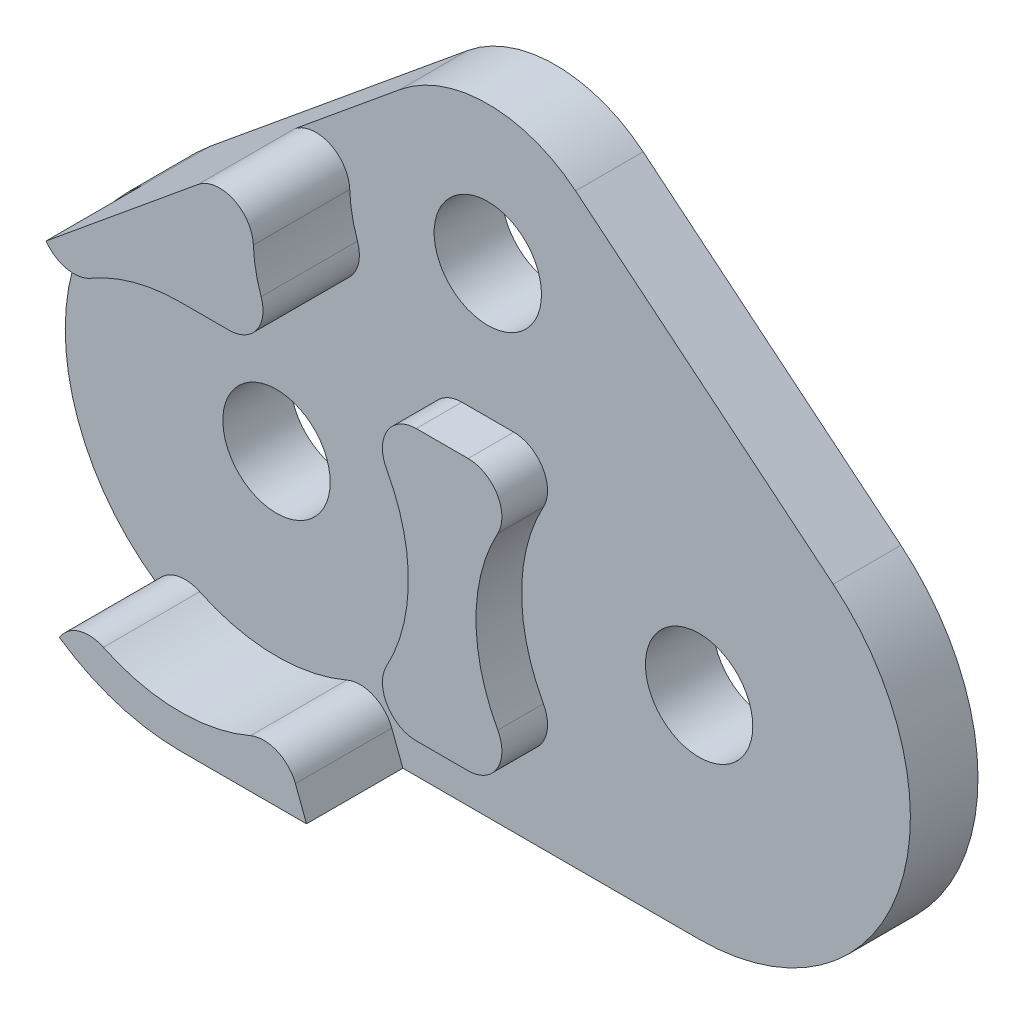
ISO-10303-21;
HEADER;
FILE_DESCRIPTION(('STEP AP214'),'2;1');
FILE_NAME('part.step','',(''),(''),'','','');
FILE_SCHEMA(('AUTOMOTIVE_DESIGN { 1 0 10303 214 1 1 1 1 }'));
ENDSEC;
DATA;
#1=APPLICATION_CONTEXT('core data for automotive mechanical design processes');
#2=APPLICATION_PROTOCOL_DEFINITION('international standard','automotive_design',2000,#1);
#3=PRODUCT_CONTEXT('',#1,'mechanical');
#4=PRODUCT('Part','Part','',(#3));
#5=PRODUCT_RELATED_PRODUCT_CATEGORY('part','',(#4));
#6=PRODUCT_DEFINITION_FORMATION('','',#4);
#7=PRODUCT_DEFINITION_CONTEXT('part definition',#1,'design');
#8=PRODUCT_DEFINITION('design','',#6,#7);
#9=PRODUCT_DEFINITION_SHAPE('','',#8);
#10=(LENGTH_UNIT() NAMED_UNIT(*) SI_UNIT(.MILLI.,.METRE.));
#11=(NAMED_UNIT(*) PLANE_ANGLE_UNIT() SI_UNIT($,.RADIAN.));
#12=(NAMED_UNIT(*) SI_UNIT($,.STERADIAN.) SOLID_ANGLE_UNIT());
#13=UNCERTAINTY_MEASURE_WITH_UNIT(LENGTH_MEASURE(1.E-05),#10,'distance_accuracy_value','');
#14=(GEOMETRIC_REPRESENTATION_CONTEXT(3) GLOBAL_UNCERTAINTY_ASSIGNED_CONTEXT((#13)) GLOBAL_UNIT_ASSIGNED_CONTEXT((#10,
#11,#12)) REPRESENTATION_CONTEXT('',''));
#15=CARTESIAN_POINT('',(0.,0.,0.));
#16=DIRECTION('',(0.,0.,1.));
#17=DIRECTION('',(1.,0.,0.));
#18=AXIS2_PLACEMENT_3D('',#15,#16,#17);
#19=CARTESIAN_POINT('',(-6.25,0.,2.));
#20=DIRECTION('',(0.,0.,1.));
#21=DIRECTION('',(1.,0.,0.));
#22=AXIS2_PLACEMENT_3D('',#19,#20,#21);
#23=PLANE('',#22);
#24=CARTESIAN_POINT('',(6.25,0.,2.));
#25=DIRECTION('',(0.,0.,1.));
#26=DIRECTION('',(1.,0.,0.));
#27=AXIS2_PLACEMENT_3D('',#24,#25,#26);
#28=CIRCLE('',#27,1.5875);
#29=CARTESIAN_POINT('',(7.8375,0.,2.));
#30=VERTEX_POINT('',#29);
#31=EDGE_CURVE('E309',#30,#30,#28,.T.);
#32=ORIENTED_EDGE('',*,*,#31,.F.);
#33=EDGE_LOOP('',(#32));
#34=FACE_BOUND('',#33,.T.);
#35=CARTESIAN_POINT('',(-6.25,0.,2.));
#36=DIRECTION('',(0.,0.,1.));
#37=DIRECTION('',(1.,0.,0.));
#38=AXIS2_PLACEMENT_3D('',#35,#36,#37);
#39=CIRCLE('',#38,1.5875);
#40=CARTESIAN_POINT('',(-4.6625,0.,2.));
#41=VERTEX_POINT('',#40);
#42=EDGE_CURVE('E323',#41,#41,#39,.T.);
#43=ORIENTED_EDGE('',*,*,#42,.F.);
#44=EDGE_LOOP('',(#43));
#45=FACE_BOUND('',#44,.T.);
#46=CARTESIAN_POINT('',(0.,7.93750000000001,2.));
#47=DIRECTION('',(0.,0.,1.));
#48=DIRECTION('',(1.,0.,0.));
#49=AXIS2_PLACEMENT_3D('',#46,#47,#48);
#50=CIRCLE('',#49,1.5875);
#51=CARTESIAN_POINT('',(1.5875,7.93750000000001,2.));
#52=VERTEX_POINT('',#51);
#53=EDGE_CURVE('E300',#52,#52,#50,.T.);
#54=ORIENTED_EDGE('',*,*,#53,.F.);
#55=EDGE_LOOP('',(#54));
#56=FACE_BOUND('',#55,.T.);
#57=CARTESIAN_POINT('',(-6.25,0.,2.));
#58=DIRECTION('',(0.,0.,1.));
#59=DIRECTION('',(1.,0.,0.));
#60=AXIS2_PLACEMENT_3D('',#57,#58,#59);
#61=CIRCLE('',#60,5.25);
#62=CARTESIAN_POINT('',(-4.17199093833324,-4.82124240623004,2.));
#63=VERTEX_POINT('',#62);
#64=CARTESIAN_POINT('',(-8.52200352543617,-4.73291664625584,2.));
#65=VERTEX_POINT('',#64);
#66=EDGE_CURVE('E252',#63,#65,#61,.F.);
#67=ORIENTED_EDGE('',*,*,#66,.F.);
#68=CARTESIAN_POINT('',(-3.77617968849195,-5.739574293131,2.));
#69=DIRECTION('',(0.,0.,1.));
#70=DIRECTION('',(1.,0.,0.));
#71=AXIS2_PLACEMENT_3D('',#68,#69,#70);
#72=CIRCLE('',#71,1.);
#73=CARTESIAN_POINT('',(-2.84132364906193,-5.38454727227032,2.));
#74=VERTEX_POINT('',#73);
#75=EDGE_CURVE('E411',#63,#74,#72,.F.);
#76=ORIENTED_EDGE('',*,*,#75,.T.);
#77=DIRECTION('',(0.35502702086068,-0.934856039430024,0.));
#78=VECTOR('',#77,1.);
#79=CARTESIAN_POINT('',(-4.27031801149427,-1.62172379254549,2.));
#80=LINE('',#79,#78);
#81=CARTESIAN_POINT('',(-2.51265368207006,-6.25,2.));
#82=VERTEX_POINT('',#81);
#83=EDGE_CURVE('E250',#74,#82,#80,.T.);
#84=ORIENTED_EDGE('',*,*,#83,.T.);
#85=DIRECTION('',(1.,0.,0.));
#86=VECTOR('',#85,1.);
#87=CARTESIAN_POINT('',(-6.25,-6.25,2.));
#88=LINE('',#87,#86);
#89=CARTESIAN_POINT('',(6.25,-6.25000000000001,2.));
#90=VERTEX_POINT('',#89);
#91=EDGE_CURVE('E334',#82,#90,#88,.T.);
#92=ORIENTED_EDGE('',*,*,#91,.T.);
#93=CARTESIAN_POINT('',(6.25,0.,2.));
#94=DIRECTION('',(0.,0.,1.));
#95=DIRECTION('',(-1.,0.,0.));
#96=AXIS2_PLACEMENT_3D('',#93,#94,#95);
#97=CIRCLE('',#96,6.25);
#98=CARTESIAN_POINT('',(10.2190264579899,4.8279735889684,2.));
#99=VERTEX_POINT('',#98);
#100=EDGE_CURVE('E337',#90,#99,#97,.T.);
#101=ORIENTED_EDGE('',*,*,#100,.T.);
#102=DIRECTION('',(0.772475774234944,-0.635044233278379,0.));
#103=VECTOR('',#102,1.);
#104=CARTESIAN_POINT('',(6.48953382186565,7.8939503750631,2.));
#105=LINE('',#104,#103);
#106=CARTESIAN_POINT('',(2.59574330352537,11.0949947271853,2.));
#107=VERTEX_POINT('',#106);
#108=EDGE_CURVE('E290',#107,#99,#105,.T.);
#109=ORIENTED_EDGE('',*,*,#108,.F.);
#110=CARTESIAN_POINT('',(0.,7.93750000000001,2.));
#111=DIRECTION('',(0.,0.,1.));
#112=DIRECTION('',(1.,0.,0.));
#113=AXIS2_PLACEMENT_3D('',#110,#111,#112);
#114=CIRCLE('',#113,4.0875);
#115=CARTESIAN_POINT('',(-2.59574330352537,11.0949947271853,2.));
#116=VERTEX_POINT('',#115);
#117=EDGE_CURVE('E295',#116,#107,#114,.F.);
#118=ORIENTED_EDGE('',*,*,#117,.F.);
#119=DIRECTION('',(0.772475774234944,0.635044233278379,0.));
#120=VECTOR('',#119,1.);
#121=CARTESIAN_POINT('',(-6.48953382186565,7.8939503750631,2.));
#122=LINE('',#121,#120);
#123=CARTESIAN_POINT('',(-5.71925938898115,8.52718490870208,2.));
#124=VERTEX_POINT('',#123);
#125=EDGE_CURVE('E406',#124,#116,#122,.T.);
#126=ORIENTED_EDGE('',*,*,#125,.F.);
#127=CARTESIAN_POINT('',(-5.08421515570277,7.75470913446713,2.));
#128=DIRECTION('',(0.,0.,1.));
#129=DIRECTION('',(1.,0.,0.));
#130=AXIS2_PLACEMENT_3D('',#127,#128,#129);
#131=CIRCLE('',#130,1.);
#132=CARTESIAN_POINT('',(-4.0848608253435,7.79063854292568,2.));
#133=VERTEX_POINT('',#132);
#134=EDGE_CURVE('E11',#124,#133,#131,.F.);
#135=ORIENTED_EDGE('',*,*,#134,.T.);
#136=CARTESIAN_POINT('',(0.,7.93750000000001,2.));
#137=DIRECTION('',(0.,0.,1.));
#138=DIRECTION('',(1.,0.,0.));
#139=AXIS2_PLACEMENT_3D('',#136,#137,#138);
#140=CIRCLE('',#139,4.0875);
#141=CARTESIAN_POINT('',(-3.85609257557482,6.58169533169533,2.));
#142=VERTEX_POINT('',#141);
#143=EDGE_CURVE('E277',#142,#133,#140,.F.);
#144=ORIENTED_EDGE('',*,*,#143,.F.);
#145=CARTESIAN_POINT('',(-4.79947913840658,6.25,2.));
#146=DIRECTION('',(0.,0.,1.));
#147=DIRECTION('',(1.,0.,0.));
#148=AXIS2_PLACEMENT_3D('',#145,#146,#147);
#149=CIRCLE('',#148,1.);
#150=CARTESIAN_POINT('',(-4.79947913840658,5.25,2.));
#151=VERTEX_POINT('',#150);
#152=EDGE_CURVE('E43',#142,#151,#149,.F.);
#153=ORIENTED_EDGE('',*,*,#152,.T.);
#154=DIRECTION('',(1.,0.,0.));
#155=VECTOR('',#154,1.);
#156=CARTESIAN_POINT('',(0.,5.24999999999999,2.));
#157=LINE('',#156,#155);
#158=CARTESIAN_POINT('',(-6.25,5.25,2.));
#159=VERTEX_POINT('',#158);
#160=EDGE_CURVE('E239',#159,#151,#157,.T.);
#161=ORIENTED_EDGE('',*,*,#160,.F.);
#162=CARTESIAN_POINT('',(-6.25,0.,2.));
#163=DIRECTION('',(0.,0.,1.));
#164=DIRECTION('',(1.,0.,0.));
#165=AXIS2_PLACEMENT_3D('',#162,#163,#164);
#166=CIRCLE('',#165,5.25);
#167=CARTESIAN_POINT('',(-8.8921509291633,4.53668805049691,2.));
#168=VERTEX_POINT('',#167);
#169=EDGE_CURVE('E264',#159,#168,#166,.T.);
#170=ORIENTED_EDGE('',*,*,#169,.T.);
#171=CARTESIAN_POINT('',(-9.39541777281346,5.40081910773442,2.));
#172=DIRECTION('',(0.,0.,1.));
#173=DIRECTION('',(1.,0.,0.));
#174=AXIS2_PLACEMENT_3D('',#171,#172,#173);
#175=CIRCLE('',#174,1.);
#176=CARTESIAN_POINT('',(-10.1678935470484,4.76577487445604,2.));
#177=VERTEX_POINT('',#176);
#178=EDGE_CURVE('E423',#168,#177,#175,.F.);
#179=ORIENTED_EDGE('',*,*,#178,.T.);
#180=DIRECTION('',(-0.635044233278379,0.772475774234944,0.));
#181=VECTOR('',#180,1.);
#182=CARTESIAN_POINT('',(-3.72949263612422,-3.0659767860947,2.));
#183=LINE('',#182,#181);
#184=CARTESIAN_POINT('',(-10.2190264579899,4.8279735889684,2.));
#185=VERTEX_POINT('',#184);
#186=EDGE_CURVE('E280',#177,#185,#183,.T.);
#187=ORIENTED_EDGE('',*,*,#186,.T.);
#188=CARTESIAN_POINT('',(-6.25,0.,2.));
#189=DIRECTION('',(0.,0.,1.));
#190=DIRECTION('',(1.,0.,0.));
#191=AXIS2_PLACEMENT_3D('',#188,#189,#190);
#192=CIRCLE('',#191,6.25);
#193=CARTESIAN_POINT('',(-9.82142857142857,-5.12907379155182,2.));
#194=VERTEX_POINT('',#193);
#195=EDGE_CURVE('E332',#185,#194,#192,.T.);
#196=ORIENTED_EDGE('',*,*,#195,.T.);
#197=DIRECTION('',(-0.571428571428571,-0.82065180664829,0.));
#198=VECTOR('',#197,1.);
#199=CARTESIAN_POINT('',(-4.2091836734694,2.93089930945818,2.));
#200=LINE('',#199,#198);
#201=CARTESIAN_POINT('',(-9.77541790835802,-5.06299600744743,2.));
#202=VERTEX_POINT('',#201);
#203=EDGE_CURVE('E235',#202,#194,#200,.T.);
#204=ORIENTED_EDGE('',*,*,#203,.F.);
#205=CARTESIAN_POINT('',(-8.95476610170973,-5.634424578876,2.));
#206=DIRECTION('',(0.,0.,1.));
#207=DIRECTION('',(1.,0.,0.));
#208=AXIS2_PLACEMENT_3D('',#205,#206,#207);
#209=CIRCLE('',#208,1.);
#210=EDGE_CURVE('E421',#202,#65,#209,.F.);
#211=ORIENTED_EDGE('',*,*,#210,.T.);
#212=EDGE_LOOP('',(#67,#76,#84,#92,#101,#109,#118,#126,#135,#144,#153,#161,#170,#179,#187,#196,
#204,#211));
#213=FACE_BOUND('',#212,.T.);
#214=DIRECTION('',(1.,0.,0.));
#215=VECTOR('',#214,1.);
#216=CARTESIAN_POINT('',(-2.84963237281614,-4.,2.));
#217=LINE('',#216,#215);
#218=CARTESIAN_POINT('',(-0.767071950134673,-4.,2.));
#219=VERTEX_POINT('',#218);
#220=CARTESIAN_POINT('',(0.767071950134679,-4.,2.));
#221=VERTEX_POINT('',#220);
#222=EDGE_CURVE('E547',#219,#221,#217,.T.);
#223=ORIENTED_EDGE('',*,*,#222,.F.);
#224=CARTESIAN_POINT('',(-0.767071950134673,-3.,2.));
#225=DIRECTION('',(0.,0.,1.));
#226=DIRECTION('',(1.,0.,0.));
#227=AXIS2_PLACEMENT_3D('',#224,#225,#226);
#228=CIRCLE('',#227,1.);
#229=CARTESIAN_POINT('',(-1.64434043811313,-2.52,2.));
#230=VERTEX_POINT('',#229);
#231=EDGE_CURVE('E413',#219,#230,#228,.F.);
#232=ORIENTED_EDGE('',*,*,#231,.T.);
#233=CARTESIAN_POINT('',(-6.25,0.,2.));
#234=DIRECTION('',(0.,0.,-1.));
#235=DIRECTION('',(-1.,0.,0.));
#236=AXIS2_PLACEMENT_3D('',#233,#234,#235);
#237=CIRCLE('',#236,5.25);
#238=CARTESIAN_POINT('',(-1.64434043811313,2.52,2.));
#239=VERTEX_POINT('',#238);
#240=EDGE_CURVE('E544',#239,#230,#237,.T.);
#241=ORIENTED_EDGE('',*,*,#240,.F.);
#242=CARTESIAN_POINT('',(-0.767071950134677,3.,2.));
#243=DIRECTION('',(0.,0.,1.));
#244=DIRECTION('',(1.,0.,0.));
#245=AXIS2_PLACEMENT_3D('',#242,#243,#244);
#246=CIRCLE('',#245,1.);
#247=CARTESIAN_POINT('',(-0.767071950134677,4.,2.));
#248=VERTEX_POINT('',#247);
#249=EDGE_CURVE('E419',#239,#248,#246,.F.);
#250=ORIENTED_EDGE('',*,*,#249,.T.);
#251=DIRECTION('',(-1.,0.,0.));
#252=VECTOR('',#251,1.);
#253=CARTESIAN_POINT('',(-2.84963237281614,4.,2.));
#254=LINE('',#253,#252);
#255=CARTESIAN_POINT('',(0.76707195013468,4.,2.));
#256=VERTEX_POINT('',#255);
#257=EDGE_CURVE('E553',#256,#248,#254,.T.);
#258=ORIENTED_EDGE('',*,*,#257,.F.);
#259=CARTESIAN_POINT('',(0.76707195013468,3.,2.));
#260=DIRECTION('',(0.,0.,1.));
#261=DIRECTION('',(1.,0.,0.));
#262=AXIS2_PLACEMENT_3D('',#259,#260,#261);
#263=CIRCLE('',#262,1.);
#264=CARTESIAN_POINT('',(1.64434043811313,2.52,2.));
#265=VERTEX_POINT('',#264);
#266=EDGE_CURVE('E417',#256,#265,#263,.F.);
#267=ORIENTED_EDGE('',*,*,#266,.T.);
#268=CARTESIAN_POINT('',(6.25,0.,2.));
#269=DIRECTION('',(0.,0.,-1.));
#270=DIRECTION('',(1.,0.,0.));
#271=AXIS2_PLACEMENT_3D('',#268,#269,#270);
#272=CIRCLE('',#271,5.25);
#273=CARTESIAN_POINT('',(1.64434043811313,-2.52,2.));
#274=VERTEX_POINT('',#273);
#275=EDGE_CURVE('E550',#274,#265,#272,.T.);
#276=ORIENTED_EDGE('',*,*,#275,.F.);
#277=CARTESIAN_POINT('',(0.767071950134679,-3.,2.));
#278=DIRECTION('',(0.,0.,1.));
#279=DIRECTION('',(1.,0.,0.));
#280=AXIS2_PLACEMENT_3D('',#277,#278,#279);
#281=CIRCLE('',#280,1.);
#282=EDGE_CURVE('E415',#274,#221,#281,.F.);
#283=ORIENTED_EDGE('',*,*,#282,.T.);
#284=EDGE_LOOP('',(#223,#232,#241,#250,#258,#267,#276,#283));
#285=FACE_BOUND('',#284,.T.);
#286=ADVANCED_FACE('F35',(#34,#45,#56,#213,#285),#23,.T.);
#287=CARTESIAN_POINT('',(6.25,0.,2.));
#288=DIRECTION('',(0.,0.,-1.));
#289=DIRECTION('',(-1.,0.,0.));
#290=AXIS2_PLACEMENT_3D('',#287,#288,#289);
#291=CYLINDRICAL_SURFACE('',#290,6.25);
#292=DIRECTION('',(0.,0.,1.));
#293=VECTOR('',#292,1.);
#294=CARTESIAN_POINT('',(10.2190264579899,4.8279735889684,-21.668207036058));
#295=LINE('',#294,#293);
#296=CARTESIAN_POINT('',(10.2190264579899,4.8279735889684,0.));
#297=VERTEX_POINT('',#296);
#298=EDGE_CURVE('E293',#297,#99,#295,.T.);
#299=ORIENTED_EDGE('',*,*,#298,.T.);
#300=ORIENTED_EDGE('',*,*,#100,.F.);
#301=DIRECTION('',(0.,0.,-1.));
#302=VECTOR('',#301,1.);
#303=CARTESIAN_POINT('',(6.25,-6.25000000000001,2.));
#304=LINE('',#303,#302);
#305=CARTESIAN_POINT('',(6.25,-6.25000000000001,0.));
#306=VERTEX_POINT('',#305);
#307=EDGE_CURVE('E340',#90,#306,#304,.T.);
#308=ORIENTED_EDGE('',*,*,#307,.T.);
#309=CARTESIAN_POINT('',(6.25,0.,0.));
#310=DIRECTION('',(0.,0.,1.));
#311=DIRECTION('',(-1.,0.,0.));
#312=AXIS2_PLACEMENT_3D('',#309,#310,#311);
#313=CIRCLE('',#312,6.25);
#314=EDGE_CURVE('E335',#306,#297,#313,.T.);
#315=ORIENTED_EDGE('',*,*,#314,.T.);
#316=EDGE_LOOP('',(#299,#300,#308,#315));
#317=FACE_BOUND('',#316,.T.);
#318=ADVANCED_FACE('F482',(#317),#291,.T.);
#319=CARTESIAN_POINT('',(-6.25,0.,2.));
#320=DIRECTION('',(0.,0.,-1.));
#321=DIRECTION('',(-1.,0.,0.));
#322=AXIS2_PLACEMENT_3D('',#319,#320,#321);
#323=CYLINDRICAL_SURFACE('',#322,6.25);
#324=ORIENTED_EDGE('',*,*,#195,.F.);
#325=DIRECTION('',(0.,0.,1.));
#326=VECTOR('',#325,1.);
#327=CARTESIAN_POINT('',(-10.2190264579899,4.8279735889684,-21.668207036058));
#328=LINE('',#327,#326);
#329=CARTESIAN_POINT('',(-10.2190264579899,4.8279735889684,0.));
#330=VERTEX_POINT('',#329);
#331=EDGE_CURVE('E303',#330,#185,#328,.T.);
#332=ORIENTED_EDGE('',*,*,#331,.F.);
#333=CARTESIAN_POINT('',(-6.25,0.,0.));
#334=DIRECTION('',(0.,0.,1.));
#335=DIRECTION('',(1.,0.,0.));
#336=AXIS2_PLACEMENT_3D('',#333,#334,#335);
#337=CIRCLE('',#336,6.25);
#338=CARTESIAN_POINT('',(-6.25,-6.25,0.));
#339=VERTEX_POINT('',#338);
#340=EDGE_CURVE('E329',#330,#339,#337,.T.);
#341=ORIENTED_EDGE('',*,*,#340,.T.);
#342=DIRECTION('',(0.,0.,-1.));
#343=VECTOR('',#342,1.);
#344=CARTESIAN_POINT('',(-6.25,-6.25,2.));
#345=LINE('',#344,#343);
#346=CARTESIAN_POINT('',(-6.25,-6.25,4.85));
#347=VERTEX_POINT('',#346);
#348=EDGE_CURVE('E244',#347,#339,#345,.T.);
#349=ORIENTED_EDGE('',*,*,#348,.F.);
#350=CARTESIAN_POINT('',(-6.25,0.,4.85));
#351=DIRECTION('',(0.,0.,1.));
#352=DIRECTION('',(1.,0.,0.));
#353=AXIS2_PLACEMENT_3D('',#350,#351,#352);
#354=CIRCLE('',#353,6.25);
#355=CARTESIAN_POINT('',(-9.82142857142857,-5.12907379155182,4.85));
#356=VERTEX_POINT('',#355);
#357=EDGE_CURVE('E221',#356,#347,#354,.T.);
#358=ORIENTED_EDGE('',*,*,#357,.F.);
#359=DIRECTION('',(0.,0.,-1.));
#360=VECTOR('',#359,1.);
#361=CARTESIAN_POINT('',(-9.82142857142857,-5.12907379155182,4.85));
#362=LINE('',#361,#360);
#363=EDGE_CURVE('E232',#356,#194,#362,.T.);
#364=ORIENTED_EDGE('',*,*,#363,.T.);
#365=EDGE_LOOP('',(#324,#332,#341,#349,#358,#364));
#366=FACE_BOUND('',#365,.T.);
#367=ADVANCED_FACE('F242',(#366),#323,.T.);
#368=CARTESIAN_POINT('',(-6.25,-6.25,2.));
#369=DIRECTION('',(0.,1.,0.));
#370=DIRECTION('',(0.,0.,1.));
#371=AXIS2_PLACEMENT_3D('',#368,#369,#370);
#372=PLANE('',#371);
#373=DIRECTION('',(1.,0.,0.));
#374=VECTOR('',#373,1.);
#375=CARTESIAN_POINT('',(-6.25,-6.25,0.));
#376=LINE('',#375,#374);
#377=EDGE_CURVE('E342',#339,#306,#376,.T.);
#378=ORIENTED_EDGE('',*,*,#377,.T.);
#379=ORIENTED_EDGE('',*,*,#307,.F.);
#380=ORIENTED_EDGE('',*,*,#91,.F.);
#381=DIRECTION('',(0.,0.,-1.));
#382=VECTOR('',#381,1.);
#383=CARTESIAN_POINT('',(-2.51265368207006,-6.25,4.85));
#384=LINE('',#383,#382);
#385=CARTESIAN_POINT('',(-2.51265368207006,-6.25,4.85));
#386=VERTEX_POINT('',#385);
#387=EDGE_CURVE('E240',#386,#82,#384,.T.);
#388=ORIENTED_EDGE('',*,*,#387,.F.);
#389=DIRECTION('',(1.,0.,0.));
#390=VECTOR('',#389,1.);
#391=CARTESIAN_POINT('',(0.,-6.25,4.85));
#392=LINE('',#391,#390);
#393=EDGE_CURVE('E245',#347,#386,#392,.T.);
#394=ORIENTED_EDGE('',*,*,#393,.F.);
#395=ORIENTED_EDGE('',*,*,#348,.T.);
#396=EDGE_LOOP('',(#378,#379,#380,#388,#394,#395));
#397=FACE_BOUND('',#396,.T.);
#398=ADVANCED_FACE('F498',(#397),#372,.F.);
#399=CARTESIAN_POINT('',(-6.25,0.,0.));
#400=DIRECTION('',(0.,0.,1.));
#401=DIRECTION('',(1.,0.,0.));
#402=AXIS2_PLACEMENT_3D('',#399,#400,#401);
#403=PLANE('',#402);
#404=DIRECTION('',(-0.772475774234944,0.635044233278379,0.));
#405=VECTOR('',#404,1.);
#406=CARTESIAN_POINT('',(6.48953382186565,7.8939503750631,0.));
#407=LINE('',#406,#405);
#408=CARTESIAN_POINT('',(2.59574330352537,11.0949947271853,0.));
#409=VERTEX_POINT('',#408);
#410=EDGE_CURVE('E298',#297,#409,#407,.T.);
#411=ORIENTED_EDGE('',*,*,#410,.F.);
#412=ORIENTED_EDGE('',*,*,#314,.F.);
#413=ORIENTED_EDGE('',*,*,#377,.F.);
#414=ORIENTED_EDGE('',*,*,#340,.F.);
#415=DIRECTION('',(0.772475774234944,0.635044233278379,0.));
#416=VECTOR('',#415,1.);
#417=CARTESIAN_POINT('',(-6.48953382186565,7.8939503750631,0.));
#418=LINE('',#417,#416);
#419=CARTESIAN_POINT('',(-2.59574330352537,11.0949947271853,0.));
#420=VERTEX_POINT('',#419);
#421=EDGE_CURVE('E307',#330,#420,#418,.T.);
#422=ORIENTED_EDGE('',*,*,#421,.T.);
#423=CARTESIAN_POINT('',(0.,7.93750000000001,0.));
#424=DIRECTION('',(0.,0.,1.));
#425=DIRECTION('',(1.,0.,0.));
#426=AXIS2_PLACEMENT_3D('',#423,#424,#425);
#427=CIRCLE('',#426,4.0875);
#428=EDGE_CURVE('E289',#409,#420,#427,.T.);
#429=ORIENTED_EDGE('',*,*,#428,.F.);
#430=EDGE_LOOP('',(#411,#412,#413,#414,#422,#429));
#431=FACE_BOUND('',#430,.T.);
#432=CARTESIAN_POINT('',(6.25,0.,0.));
#433=DIRECTION('',(0.,0.,1.));
#434=DIRECTION('',(1.,0.,0.));
#435=AXIS2_PLACEMENT_3D('',#432,#433,#434);
#436=CIRCLE('',#435,1.5875);
#437=CARTESIAN_POINT('',(7.8375,0.,0.));
#438=VERTEX_POINT('',#437);
#439=EDGE_CURVE('E320',#438,#438,#436,.T.);
#440=ORIENTED_EDGE('',*,*,#439,.T.);
#441=EDGE_LOOP('',(#440));
#442=FACE_BOUND('',#441,.T.);
#443=CARTESIAN_POINT('',(-6.25,0.,0.));
#444=DIRECTION('',(0.,0.,1.));
#445=DIRECTION('',(1.,0.,0.));
#446=AXIS2_PLACEMENT_3D('',#443,#444,#445);
#447=CIRCLE('',#446,1.5875);
#448=CARTESIAN_POINT('',(-4.6625,0.,0.));
#449=VERTEX_POINT('',#448);
#450=EDGE_CURVE('E326',#449,#449,#447,.T.);
#451=ORIENTED_EDGE('',*,*,#450,.T.);
#452=EDGE_LOOP('',(#451));
#453=FACE_BOUND('',#452,.T.);
#454=CARTESIAN_POINT('',(0.,7.93750000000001,0.));
#455=DIRECTION('',(0.,0.,1.));
#456=DIRECTION('',(1.,0.,0.));
#457=AXIS2_PLACEMENT_3D('',#454,#455,#456);
#458=CIRCLE('',#457,1.5875);
#459=CARTESIAN_POINT('',(1.5875,7.93750000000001,0.));
#460=VERTEX_POINT('',#459);
#461=EDGE_CURVE('E304',#460,#460,#458,.F.);
#462=ORIENTED_EDGE('',*,*,#461,.F.);
#463=EDGE_LOOP('',(#462));
#464=FACE_BOUND('',#463,.T.);
#465=ADVANCED_FACE('F496',(#431,#442,#453,#464),#403,.F.);
#466=CARTESIAN_POINT('',(-6.25,0.,0.));
#467=DIRECTION('',(0.,0.,1.));
#468=DIRECTION('',(1.,0.,0.));
#469=AXIS2_PLACEMENT_3D('',#466,#467,#468);
#470=CYLINDRICAL_SURFACE('',#469,1.5875);
#471=ORIENTED_EDGE('',*,*,#450,.F.);
#472=EDGE_LOOP('',(#471));
#473=FACE_BOUND('',#472,.T.);
#474=ORIENTED_EDGE('',*,*,#42,.T.);
#475=EDGE_LOOP('',(#474));
#476=FACE_BOUND('',#475,.T.);
#477=ADVANCED_FACE('F494',(#473,#476),#470,.F.);
#478=CARTESIAN_POINT('',(6.25,0.,0.));
#479=DIRECTION('',(0.,0.,1.));
#480=DIRECTION('',(1.,0.,0.));
#481=AXIS2_PLACEMENT_3D('',#478,#479,#480);
#482=CYLINDRICAL_SURFACE('',#481,1.5875);
#483=ORIENTED_EDGE('',*,*,#439,.F.);
#484=EDGE_LOOP('',(#483));
#485=FACE_BOUND('',#484,.T.);
#486=ORIENTED_EDGE('',*,*,#31,.T.);
#487=EDGE_LOOP('',(#486));
#488=FACE_BOUND('',#487,.T.);
#489=ADVANCED_FACE('F596',(#485,#488),#482,.F.);
#490=CARTESIAN_POINT('',(0.,7.93750000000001,-21.668207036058));
#491=DIRECTION('',(0.,0.,1.));
#492=DIRECTION('',(1.,0.,0.));
#493=AXIS2_PLACEMENT_3D('',#490,#491,#492);
#494=CYLINDRICAL_SURFACE('',#493,4.0875);
#495=DIRECTION('',(0.,0.,1.));
#496=VECTOR('',#495,1.);
#497=CARTESIAN_POINT('',(2.59574330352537,11.0949947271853,-21.668207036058));
#498=LINE('',#497,#496);
#499=EDGE_CURVE('E294',#409,#107,#498,.T.);
#500=ORIENTED_EDGE('',*,*,#499,.F.);
#501=ORIENTED_EDGE('',*,*,#428,.T.);
#502=DIRECTION('',(0.,0.,1.));
#503=VECTOR('',#502,1.);
#504=CARTESIAN_POINT('',(-2.59574330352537,11.0949947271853,-21.668207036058));
#505=LINE('',#504,#503);
#506=EDGE_CURVE('E299',#420,#116,#505,.T.);
#507=ORIENTED_EDGE('',*,*,#506,.T.);
#508=ORIENTED_EDGE('',*,*,#117,.T.);
#509=EDGE_LOOP('',(#500,#501,#507,#508));
#510=FACE_BOUND('',#509,.T.);
#511=ADVANCED_FACE('F571',(#510),#494,.T.);
#512=CARTESIAN_POINT('',(6.48953382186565,7.8939503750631,-21.668207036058));
#513=DIRECTION('',(-0.635044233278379,-0.772475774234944,0.));
#514=DIRECTION('',(0.772475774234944,-0.635044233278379,0.));
#515=AXIS2_PLACEMENT_3D('',#512,#513,#514);
#516=PLANE('',#515);
#517=ORIENTED_EDGE('',*,*,#298,.F.);
#518=ORIENTED_EDGE('',*,*,#410,.T.);
#519=ORIENTED_EDGE('',*,*,#499,.T.);
#520=ORIENTED_EDGE('',*,*,#108,.T.);
#521=EDGE_LOOP('',(#517,#518,#519,#520));
#522=FACE_BOUND('',#521,.T.);
#523=ADVANCED_FACE('F567',(#522),#516,.F.);
#524=CARTESIAN_POINT('',(0.,7.93750000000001,-21.668207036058));
#525=DIRECTION('',(0.,0.,1.));
#526=DIRECTION('',(1.,0.,0.));
#527=AXIS2_PLACEMENT_3D('',#524,#525,#526);
#528=CYLINDRICAL_SURFACE('',#527,1.5875);
#529=ORIENTED_EDGE('',*,*,#461,.T.);
#530=EDGE_LOOP('',(#529));
#531=FACE_BOUND('',#530,.T.);
#532=ORIENTED_EDGE('',*,*,#53,.T.);
#533=EDGE_LOOP('',(#532));
#534=FACE_BOUND('',#533,.T.);
#535=ADVANCED_FACE('F580',(#531,#534),#528,.F.);
#536=CARTESIAN_POINT('',(-6.48953382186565,7.8939503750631,-21.668207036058));
#537=DIRECTION('',(-0.635044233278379,0.772475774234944,0.));
#538=DIRECTION('',(-0.772475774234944,-0.635044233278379,0.));
#539=AXIS2_PLACEMENT_3D('',#536,#537,#538);
#540=PLANE('',#539);
#541=DIRECTION('',(-0.772475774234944,-0.635044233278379,0.));
#542=VECTOR('',#541,1.);
#543=CARTESIAN_POINT('',(-6.48953382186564,7.8939503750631,4.85));
#544=LINE('',#543,#542);
#545=CARTESIAN_POINT('',(-5.71925938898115,8.52718490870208,4.85));
#546=VERTEX_POINT('',#545);
#547=CARTESIAN_POINT('',(-10.2190264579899,4.8279735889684,4.85));
#548=VERTEX_POINT('',#547);
#549=EDGE_CURVE('E267',#546,#548,#544,.T.);
#550=ORIENTED_EDGE('',*,*,#549,.F.);
#551=DIRECTION('',(0.,0.,1.));
#552=VECTOR('',#551,1.);
#553=CARTESIAN_POINT('',(-5.71925938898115,8.52718490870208,2.));
#554=LINE('',#553,#552);
#555=EDGE_CURVE('E408',#546,#124,#554,.F.);
#556=ORIENTED_EDGE('',*,*,#555,.T.);
#557=ORIENTED_EDGE('',*,*,#125,.T.);
#558=ORIENTED_EDGE('',*,*,#506,.F.);
#559=ORIENTED_EDGE('',*,*,#421,.F.);
#560=ORIENTED_EDGE('',*,*,#331,.T.);
#561=DIRECTION('',(0.,0.,-1.));
#562=VECTOR('',#561,1.);
#563=CARTESIAN_POINT('',(-10.2190264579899,4.8279735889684,4.85));
#564=LINE('',#563,#562);
#565=EDGE_CURVE('E286',#548,#185,#564,.T.);
#566=ORIENTED_EDGE('',*,*,#565,.F.);
#567=EDGE_LOOP('',(#550,#556,#557,#558,#559,#560,#566));
#568=FACE_BOUND('',#567,.T.);
#569=ADVANCED_FACE('F458',(#568),#540,.T.);
#570=CARTESIAN_POINT('',(0.,5.24999999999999,4.85));
#571=DIRECTION('',(0.,1.,0.));
#572=DIRECTION('',(-1.,0.,0.));
#573=AXIS2_PLACEMENT_3D('',#570,#571,#572);
#574=PLANE('',#573);
#575=ORIENTED_EDGE('',*,*,#160,.T.);
#576=DIRECTION('',(0.,0.,-1.));
#577=VECTOR('',#576,1.);
#578=CARTESIAN_POINT('',(-4.79947913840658,5.25,4.85));
#579=LINE('',#578,#577);
#580=CARTESIAN_POINT('',(-4.79947913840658,5.25,4.85));
#581=VERTEX_POINT('',#580);
#582=EDGE_CURVE('E404',#151,#581,#579,.F.);
#583=ORIENTED_EDGE('',*,*,#582,.T.);
#584=DIRECTION('',(1.,0.,0.));
#585=VECTOR('',#584,1.);
#586=CARTESIAN_POINT('',(0.,5.24999999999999,4.85));
#587=LINE('',#586,#585);
#588=CARTESIAN_POINT('',(-6.25,5.25,4.85));
#589=VERTEX_POINT('',#588);
#590=EDGE_CURVE('E260',#589,#581,#587,.T.);
#591=ORIENTED_EDGE('',*,*,#590,.F.);
#592=DIRECTION('',(0.,0.,-1.));
#593=VECTOR('',#592,1.);
#594=CARTESIAN_POINT('',(-6.25,5.25,4.85));
#595=LINE('',#594,#593);
#596=EDGE_CURVE('E275',#589,#159,#595,.T.);
#597=ORIENTED_EDGE('',*,*,#596,.T.);
#598=EDGE_LOOP('',(#575,#583,#591,#597));
#599=FACE_BOUND('',#598,.T.);
#600=ADVANCED_FACE('F444',(#599),#574,.F.);
#601=CARTESIAN_POINT('',(0.,7.93750000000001,4.85));
#602=DIRECTION('',(0.,0.,-1.));
#603=DIRECTION('',(-1.,0.,0.));
#604=AXIS2_PLACEMENT_3D('',#601,#602,#603);
#605=CYLINDRICAL_SURFACE('',#604,4.0875);
#606=CARTESIAN_POINT('',(0.,7.93750000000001,4.85));
#607=DIRECTION('',(0.,0.,1.));
#608=DIRECTION('',(1.,0.,0.));
#609=AXIS2_PLACEMENT_3D('',#606,#607,#608);
#610=CIRCLE('',#609,4.0875);
#611=CARTESIAN_POINT('',(-3.85609257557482,6.58169533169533,4.85));
#612=VERTEX_POINT('',#611);
#613=CARTESIAN_POINT('',(-4.0848608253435,7.79063854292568,4.85));
#614=VERTEX_POINT('',#613);
#615=EDGE_CURVE('E263',#612,#614,#610,.F.);
#616=ORIENTED_EDGE('',*,*,#615,.F.);
#617=DIRECTION('',(0.,0.,-1.));
#618=VECTOR('',#617,1.);
#619=CARTESIAN_POINT('',(-3.85609257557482,6.58169533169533,4.85));
#620=LINE('',#619,#618);
#621=EDGE_CURVE('E401',#612,#142,#620,.T.);
#622=ORIENTED_EDGE('',*,*,#621,.T.);
#623=ORIENTED_EDGE('',*,*,#143,.T.);
#624=DIRECTION('',(0.,0.,-1.));
#625=VECTOR('',#624,1.);
#626=CARTESIAN_POINT('',(-4.0848608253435,7.79063854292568,4.85));
#627=LINE('',#626,#625);
#628=EDGE_CURVE('E399',#133,#614,#627,.F.);
#629=ORIENTED_EDGE('',*,*,#628,.T.);
#630=EDGE_LOOP('',(#616,#622,#623,#629));
#631=FACE_BOUND('',#630,.T.);
#632=ADVANCED_FACE('F452',(#631),#605,.F.);
#633=CARTESIAN_POINT('',(-3.72949263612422,-3.0659767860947,4.85));
#634=DIRECTION('',(-0.772475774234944,-0.635044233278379,0.));
#635=DIRECTION('',(0.635044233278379,-0.772475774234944,0.));
#636=AXIS2_PLACEMENT_3D('',#633,#634,#635);
#637=PLANE('',#636);
#638=ORIENTED_EDGE('',*,*,#186,.F.);
#639=DIRECTION('',(0.,0.,-1.));
#640=VECTOR('',#639,1.);
#641=CARTESIAN_POINT('',(-10.1678935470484,4.76577487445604,4.85));
#642=LINE('',#641,#640);
#643=CARTESIAN_POINT('',(-10.1678935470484,4.76577487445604,4.85));
#644=VERTEX_POINT('',#643);
#645=EDGE_CURVE('E391',#177,#644,#642,.F.);
#646=ORIENTED_EDGE('',*,*,#645,.T.);
#647=DIRECTION('',(-0.635044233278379,0.772475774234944,0.));
#648=VECTOR('',#647,1.);
#649=CARTESIAN_POINT('',(-3.72949263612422,-3.0659767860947,4.85));
#650=LINE('',#649,#648);
#651=EDGE_CURVE('E269',#644,#548,#650,.T.);
#652=ORIENTED_EDGE('',*,*,#651,.T.);
#653=ORIENTED_EDGE('',*,*,#565,.T.);
#654=EDGE_LOOP('',(#638,#646,#652,#653));
#655=FACE_BOUND('',#654,.T.);
#656=ADVANCED_FACE('F432',(#655),#637,.T.);
#657=CARTESIAN_POINT('',(-6.25,0.,4.85));
#658=DIRECTION('',(0.,0.,-1.));
#659=DIRECTION('',(-1.,0.,0.));
#660=AXIS2_PLACEMENT_3D('',#657,#658,#659);
#661=CYLINDRICAL_SURFACE('',#660,5.25);
#662=CARTESIAN_POINT('',(-6.25,0.,4.85));
#663=DIRECTION('',(0.,0.,1.));
#664=DIRECTION('',(1.,0.,0.));
#665=AXIS2_PLACEMENT_3D('',#662,#663,#664);
#666=CIRCLE('',#665,5.25);
#667=CARTESIAN_POINT('',(-8.8921509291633,4.53668805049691,4.85));
#668=VERTEX_POINT('',#667);
#669=EDGE_CURVE('E272',#589,#668,#666,.T.);
#670=ORIENTED_EDGE('',*,*,#669,.T.);
#671=DIRECTION('',(0.,0.,-1.));
#672=VECTOR('',#671,1.);
#673=CARTESIAN_POINT('',(-8.8921509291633,4.53668805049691,4.85));
#674=LINE('',#673,#672);
#675=EDGE_CURVE('E388',#668,#168,#674,.T.);
#676=ORIENTED_EDGE('',*,*,#675,.T.);
#677=ORIENTED_EDGE('',*,*,#169,.F.);
#678=ORIENTED_EDGE('',*,*,#596,.F.);
#679=EDGE_LOOP('',(#670,#676,#677,#678));
#680=FACE_BOUND('',#679,.T.);
#681=ADVANCED_FACE('F441',(#680),#661,.F.);
#682=CARTESIAN_POINT('',(0.,0.,4.85));
#683=DIRECTION('',(0.,0.,1.));
#684=DIRECTION('',(1.,0.,0.));
#685=AXIS2_PLACEMENT_3D('',#682,#683,#684);
#686=PLANE('',#685);
#687=ORIENTED_EDGE('',*,*,#651,.F.);
#688=CARTESIAN_POINT('',(-9.39541777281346,5.40081910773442,4.85));
#689=DIRECTION('',(0.,0.,1.));
#690=DIRECTION('',(1.,0.,0.));
#691=AXIS2_PLACEMENT_3D('',#688,#689,#690);
#692=CIRCLE('',#691,1.);
#693=EDGE_CURVE('E397',#644,#668,#692,.T.);
#694=ORIENTED_EDGE('',*,*,#693,.T.);
#695=ORIENTED_EDGE('',*,*,#669,.F.);
#696=ORIENTED_EDGE('',*,*,#590,.T.);
#697=CARTESIAN_POINT('',(-4.79947913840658,6.25,4.85));
#698=DIRECTION('',(0.,0.,1.));
#699=DIRECTION('',(1.,0.,0.));
#700=AXIS2_PLACEMENT_3D('',#697,#698,#699);
#701=CIRCLE('',#700,1.);
#702=EDGE_CURVE('E395',#581,#612,#701,.T.);
#703=ORIENTED_EDGE('',*,*,#702,.T.);
#704=ORIENTED_EDGE('',*,*,#615,.T.);
#705=CARTESIAN_POINT('',(-5.08421515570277,7.75470913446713,4.85));
#706=DIRECTION('',(0.,0.,1.));
#707=DIRECTION('',(1.,0.,0.));
#708=AXIS2_PLACEMENT_3D('',#705,#706,#707);
#709=CIRCLE('',#708,1.);
#710=EDGE_CURVE('E393',#614,#546,#709,.T.);
#711=ORIENTED_EDGE('',*,*,#710,.T.);
#712=ORIENTED_EDGE('',*,*,#549,.T.);
#713=EDGE_LOOP('',(#687,#694,#695,#696,#703,#704,#711,#712));
#714=FACE_BOUND('',#713,.T.);
#715=ADVANCED_FACE('F439',(#714),#686,.T.);
#716=CARTESIAN_POINT('',(-4.27031801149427,-1.62172379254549,4.85));
#717=DIRECTION('',(0.934856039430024,0.35502702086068,0.));
#718=DIRECTION('',(-0.35502702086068,0.934856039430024,0.));
#719=AXIS2_PLACEMENT_3D('',#716,#717,#718);
#720=PLANE('',#719);
#721=ORIENTED_EDGE('',*,*,#83,.F.);
#722=DIRECTION('',(0.,0.,1.));
#723=VECTOR('',#722,1.);
#724=CARTESIAN_POINT('',(-2.84132364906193,-5.38454727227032,4.85));
#725=LINE('',#724,#723);
#726=CARTESIAN_POINT('',(-2.84132364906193,-5.38454727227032,4.85));
#727=VERTEX_POINT('',#726);
#728=EDGE_CURVE('E353',#74,#727,#725,.T.);
#729=ORIENTED_EDGE('',*,*,#728,.T.);
#730=DIRECTION('',(0.35502702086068,-0.934856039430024,0.));
#731=VECTOR('',#730,1.);
#732=CARTESIAN_POINT('',(-4.27031801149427,-1.62172379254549,4.85));
#733=LINE('',#732,#731);
#734=EDGE_CURVE('E257',#727,#386,#733,.T.);
#735=ORIENTED_EDGE('',*,*,#734,.T.);
#736=ORIENTED_EDGE('',*,*,#387,.T.);
#737=EDGE_LOOP('',(#721,#729,#735,#736));
#738=FACE_BOUND('',#737,.T.);
#739=ADVANCED_FACE('F561',(#738),#720,.T.);
#740=CARTESIAN_POINT('',(-6.25,0.,4.85));
#741=DIRECTION('',(0.,0.,-1.));
#742=DIRECTION('',(-1.,0.,0.));
#743=AXIS2_PLACEMENT_3D('',#740,#741,#742);
#744=CYLINDRICAL_SURFACE('',#743,5.25);
#745=CARTESIAN_POINT('',(-6.25,0.,4.85));
#746=DIRECTION('',(0.,0.,1.));
#747=DIRECTION('',(1.,0.,0.));
#748=AXIS2_PLACEMENT_3D('',#745,#746,#747);
#749=CIRCLE('',#748,5.25);
#750=CARTESIAN_POINT('',(-4.17199093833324,-4.82124240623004,4.85));
#751=VERTEX_POINT('',#750);
#752=CARTESIAN_POINT('',(-8.52200352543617,-4.73291664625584,4.85));
#753=VERTEX_POINT('',#752);
#754=EDGE_CURVE('E229',#751,#753,#749,.F.);
#755=ORIENTED_EDGE('',*,*,#754,.F.);
#756=DIRECTION('',(0.,0.,-1.));
#757=VECTOR('',#756,1.);
#758=CARTESIAN_POINT('',(-4.17199093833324,-4.82124240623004,4.85));
#759=LINE('',#758,#757);
#760=EDGE_CURVE('E350',#751,#63,#759,.T.);
#761=ORIENTED_EDGE('',*,*,#760,.T.);
#762=ORIENTED_EDGE('',*,*,#66,.T.);
#763=DIRECTION('',(0.,0.,-1.));
#764=VECTOR('',#763,1.);
#765=CARTESIAN_POINT('',(-8.52200352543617,-4.73291664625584,4.85));
#766=LINE('',#765,#764);
#767=EDGE_CURVE('E348',#65,#753,#766,.F.);
#768=ORIENTED_EDGE('',*,*,#767,.T.);
#769=EDGE_LOOP('',(#755,#761,#762,#768));
#770=FACE_BOUND('',#769,.T.);
#771=ADVANCED_FACE('F467',(#770),#744,.F.);
#772=CARTESIAN_POINT('',(-4.2091836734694,2.93089930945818,4.85));
#773=DIRECTION('',(0.82065180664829,-0.571428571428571,0.));
#774=DIRECTION('',(0.571428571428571,0.82065180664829,0.));
#775=AXIS2_PLACEMENT_3D('',#772,#773,#774);
#776=PLANE('',#775);
#777=DIRECTION('',(-0.571428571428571,-0.82065180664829,0.));
#778=VECTOR('',#777,1.);
#779=CARTESIAN_POINT('',(-4.2091836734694,2.93089930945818,4.85));
#780=LINE('',#779,#778);
#781=CARTESIAN_POINT('',(-9.77541790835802,-5.06299600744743,4.85));
#782=VERTEX_POINT('',#781);
#783=EDGE_CURVE('E215',#782,#356,#780,.T.);
#784=ORIENTED_EDGE('',*,*,#783,.F.);
#785=DIRECTION('',(0.,0.,-1.));
#786=VECTOR('',#785,1.);
#787=CARTESIAN_POINT('',(-9.77541790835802,-5.06299600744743,4.85));
#788=LINE('',#787,#786);
#789=EDGE_CURVE('E386',#782,#202,#788,.T.);
#790=ORIENTED_EDGE('',*,*,#789,.T.);
#791=ORIENTED_EDGE('',*,*,#203,.T.);
#792=ORIENTED_EDGE('',*,*,#363,.F.);
#793=EDGE_LOOP('',(#784,#790,#791,#792));
#794=FACE_BOUND('',#793,.T.);
#795=ADVANCED_FACE('F233',(#794),#776,.F.);
#796=CARTESIAN_POINT('',(0.,0.,4.85));
#797=DIRECTION('',(0.,0.,1.));
#798=DIRECTION('',(1.,0.,0.));
#799=AXIS2_PLACEMENT_3D('',#796,#797,#798);
#800=PLANE('',#799);
#801=ORIENTED_EDGE('',*,*,#734,.F.);
#802=CARTESIAN_POINT('',(-3.77617968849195,-5.739574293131,4.85));
#803=DIRECTION('',(0.,0.,1.));
#804=DIRECTION('',(1.,0.,0.));
#805=AXIS2_PLACEMENT_3D('',#802,#803,#804);
#806=CIRCLE('',#805,1.);
#807=EDGE_CURVE('E356',#727,#751,#806,.T.);
#808=ORIENTED_EDGE('',*,*,#807,.T.);
#809=ORIENTED_EDGE('',*,*,#754,.T.);
#810=CARTESIAN_POINT('',(-8.95476610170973,-5.634424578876,4.85));
#811=DIRECTION('',(0.,0.,1.));
#812=DIRECTION('',(1.,0.,0.));
#813=AXIS2_PLACEMENT_3D('',#810,#811,#812);
#814=CIRCLE('',#813,1.);
#815=EDGE_CURVE('E225',#753,#782,#814,.T.);
#816=ORIENTED_EDGE('',*,*,#815,.T.);
#817=ORIENTED_EDGE('',*,*,#783,.T.);
#818=ORIENTED_EDGE('',*,*,#357,.T.);
#819=ORIENTED_EDGE('',*,*,#393,.T.);
#820=EDGE_LOOP('',(#801,#808,#809,#816,#817,#818,#819));
#821=FACE_BOUND('',#820,.T.);
#822=ADVANCED_FACE('F218',(#821),#800,.T.);
#823=CARTESIAN_POINT('',(-6.25,0.,3.35));
#824=DIRECTION('',(0.,0.,-1.));
#825=DIRECTION('',(-1.,0.,0.));
#826=AXIS2_PLACEMENT_3D('',#823,#824,#825);
#827=CYLINDRICAL_SURFACE('',#826,5.25);
#828=ORIENTED_EDGE('',*,*,#240,.T.);
#829=DIRECTION('',(0.,0.,-1.));
#830=VECTOR('',#829,1.);
#831=CARTESIAN_POINT('',(-1.64434043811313,-2.52,3.35));
#832=LINE('',#831,#830);
#833=CARTESIAN_POINT('',(-1.64434043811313,-2.52,3.35));
#834=VERTEX_POINT('',#833);
#835=EDGE_CURVE('E366',#230,#834,#832,.F.);
#836=ORIENTED_EDGE('',*,*,#835,.T.);
#837=CARTESIAN_POINT('',(-6.25,0.,3.35));
#838=DIRECTION('',(0.,0.,-1.));
#839=DIRECTION('',(-1.,0.,0.));
#840=AXIS2_PLACEMENT_3D('',#837,#838,#839);
#841=CIRCLE('',#840,5.25);
#842=CARTESIAN_POINT('',(-1.64434043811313,2.52,3.35));
#843=VERTEX_POINT('',#842);
#844=EDGE_CURVE('E555',#843,#834,#841,.T.);
#845=ORIENTED_EDGE('',*,*,#844,.F.);
#846=DIRECTION('',(0.,0.,-1.));
#847=VECTOR('',#846,1.);
#848=CARTESIAN_POINT('',(-1.64434043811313,2.52,3.35));
#849=LINE('',#848,#847);
#850=EDGE_CURVE('E363',#843,#239,#849,.T.);
#851=ORIENTED_EDGE('',*,*,#850,.T.);
#852=EDGE_LOOP('',(#828,#836,#845,#851));
#853=FACE_BOUND('',#852,.T.);
#854=ADVANCED_FACE('F742',(#853),#827,.F.);
#855=CARTESIAN_POINT('',(-2.84963237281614,-4.,3.35));
#856=DIRECTION('',(0.,1.,0.));
#857=DIRECTION('',(-1.,0.,0.));
#858=AXIS2_PLACEMENT_3D('',#855,#856,#857);
#859=PLANE('',#858);
#860=DIRECTION('',(1.,0.,0.));
#861=VECTOR('',#860,1.);
#862=CARTESIAN_POINT('',(-2.84963237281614,-4.,3.35));
#863=LINE('',#862,#861);
#864=CARTESIAN_POINT('',(-0.767071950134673,-4.,3.35));
#865=VERTEX_POINT('',#864);
#866=CARTESIAN_POINT('',(0.767071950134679,-4.,3.35));
#867=VERTEX_POINT('',#866);
#868=EDGE_CURVE('E540',#865,#867,#863,.T.);
#869=ORIENTED_EDGE('',*,*,#868,.F.);
#870=DIRECTION('',(0.,0.,-1.));
#871=VECTOR('',#870,1.);
#872=CARTESIAN_POINT('',(-0.767071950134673,-4.,3.35));
#873=LINE('',#872,#871);
#874=EDGE_CURVE('E360',#865,#219,#873,.T.);
#875=ORIENTED_EDGE('',*,*,#874,.T.);
#876=ORIENTED_EDGE('',*,*,#222,.T.);
#877=DIRECTION('',(0.,0.,-1.));
#878=VECTOR('',#877,1.);
#879=CARTESIAN_POINT('',(0.767071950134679,-4.,3.35));
#880=LINE('',#879,#878);
#881=EDGE_CURVE('E358',#221,#867,#880,.F.);
#882=ORIENTED_EDGE('',*,*,#881,.T.);
#883=EDGE_LOOP('',(#869,#875,#876,#882));
#884=FACE_BOUND('',#883,.T.);
#885=ADVANCED_FACE('F757',(#884),#859,.F.);
#886=CARTESIAN_POINT('',(6.25,0.,3.35));
#887=DIRECTION('',(0.,0.,-1.));
#888=DIRECTION('',(-1.,0.,0.));
#889=AXIS2_PLACEMENT_3D('',#886,#887,#888);
#890=CYLINDRICAL_SURFACE('',#889,5.25);
#891=CARTESIAN_POINT('',(6.25,0.,3.35));
#892=DIRECTION('',(0.,0.,-1.));
#893=DIRECTION('',(1.,0.,0.));
#894=AXIS2_PLACEMENT_3D('',#891,#892,#893);
#895=CIRCLE('',#894,5.25);
#896=CARTESIAN_POINT('',(1.64434043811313,-2.52,3.35));
#897=VERTEX_POINT('',#896);
#898=CARTESIAN_POINT('',(1.64434043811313,2.52,3.35));
#899=VERTEX_POINT('',#898);
#900=EDGE_CURVE('E533',#897,#899,#895,.T.);
#901=ORIENTED_EDGE('',*,*,#900,.F.);
#902=DIRECTION('',(0.,0.,-1.));
#903=VECTOR('',#902,1.);
#904=CARTESIAN_POINT('',(1.64434043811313,-2.52,3.35));
#905=LINE('',#904,#903);
#906=EDGE_CURVE('E378',#897,#274,#905,.T.);
#907=ORIENTED_EDGE('',*,*,#906,.T.);
#908=ORIENTED_EDGE('',*,*,#275,.T.);
#909=DIRECTION('',(0.,0.,-1.));
#910=VECTOR('',#909,1.);
#911=CARTESIAN_POINT('',(1.64434043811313,2.52,3.35));
#912=LINE('',#911,#910);
#913=EDGE_CURVE('E376',#265,#899,#912,.F.);
#914=ORIENTED_EDGE('',*,*,#913,.T.);
#915=EDGE_LOOP('',(#901,#907,#908,#914));
#916=FACE_BOUND('',#915,.T.);
#917=ADVANCED_FACE('F766',(#916),#890,.F.);
#918=CARTESIAN_POINT('',(-2.84963237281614,4.,3.35));
#919=DIRECTION('',(0.,-1.,0.));
#920=DIRECTION('',(1.,0.,0.));
#921=AXIS2_PLACEMENT_3D('',#918,#919,#920);
#922=PLANE('',#921);
#923=DIRECTION('',(-1.,0.,0.));
#924=VECTOR('',#923,1.);
#925=CARTESIAN_POINT('',(-2.84963237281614,4.,3.35));
#926=LINE('',#925,#924);
#927=CARTESIAN_POINT('',(0.76707195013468,4.,3.35));
#928=VERTEX_POINT('',#927);
#929=CARTESIAN_POINT('',(-0.767071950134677,4.,3.35));
#930=VERTEX_POINT('',#929);
#931=EDGE_CURVE('E253',#928,#930,#926,.T.);
#932=ORIENTED_EDGE('',*,*,#931,.F.);
#933=DIRECTION('',(0.,0.,-1.));
#934=VECTOR('',#933,1.);
#935=CARTESIAN_POINT('',(0.76707195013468,4.,3.35));
#936=LINE('',#935,#934);
#937=EDGE_CURVE('E383',#928,#256,#936,.T.);
#938=ORIENTED_EDGE('',*,*,#937,.T.);
#939=ORIENTED_EDGE('',*,*,#257,.T.);
#940=DIRECTION('',(0.,0.,-1.));
#941=VECTOR('',#940,1.);
#942=CARTESIAN_POINT('',(-0.767071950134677,4.,3.35));
#943=LINE('',#942,#941);
#944=EDGE_CURVE('E381',#248,#930,#943,.F.);
#945=ORIENTED_EDGE('',*,*,#944,.T.);
#946=EDGE_LOOP('',(#932,#938,#939,#945));
#947=FACE_BOUND('',#946,.T.);
#948=ADVANCED_FACE('F535',(#947),#922,.F.);
#949=CARTESIAN_POINT('',(-6.25,0.,3.35));
#950=DIRECTION('',(0.,0.,-1.));
#951=DIRECTION('',(-1.,0.,0.));
#952=AXIS2_PLACEMENT_3D('',#949,#950,#951);
#953=PLANE('',#952);
#954=ORIENTED_EDGE('',*,*,#844,.T.);
#955=CARTESIAN_POINT('',(-0.767071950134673,-3.,3.35));
#956=DIRECTION('',(0.,0.,-1.));
#957=DIRECTION('',(-1.,0.,0.));
#958=AXIS2_PLACEMENT_3D('',#955,#956,#957);
#959=CIRCLE('',#958,1.);
#960=EDGE_CURVE('E374',#834,#865,#959,.F.);
#961=ORIENTED_EDGE('',*,*,#960,.T.);
#962=ORIENTED_EDGE('',*,*,#868,.T.);
#963=CARTESIAN_POINT('',(0.767071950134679,-3.,3.35));
#964=DIRECTION('',(0.,0.,-1.));
#965=DIRECTION('',(-1.,0.,0.));
#966=AXIS2_PLACEMENT_3D('',#963,#964,#965);
#967=CIRCLE('',#966,1.);
#968=EDGE_CURVE('E372',#867,#897,#967,.F.);
#969=ORIENTED_EDGE('',*,*,#968,.T.);
#970=ORIENTED_EDGE('',*,*,#900,.T.);
#971=CARTESIAN_POINT('',(0.76707195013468,3.,3.35));
#972=DIRECTION('',(0.,0.,-1.));
#973=DIRECTION('',(-1.,0.,0.));
#974=AXIS2_PLACEMENT_3D('',#971,#972,#973);
#975=CIRCLE('',#974,1.);
#976=EDGE_CURVE('E370',#899,#928,#975,.F.);
#977=ORIENTED_EDGE('',*,*,#976,.T.);
#978=ORIENTED_EDGE('',*,*,#931,.T.);
#979=CARTESIAN_POINT('',(-0.767071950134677,3.,3.35));
#980=DIRECTION('',(0.,0.,-1.));
#981=DIRECTION('',(-1.,0.,0.));
#982=AXIS2_PLACEMENT_3D('',#979,#980,#981);
#983=CIRCLE('',#982,1.);
#984=EDGE_CURVE('E368',#930,#843,#983,.F.);
#985=ORIENTED_EDGE('',*,*,#984,.T.);
#986=EDGE_LOOP('',(#954,#961,#962,#969,#970,#977,#978,#985));
#987=FACE_BOUND('',#986,.T.);
#988=ADVANCED_FACE('F510',(#987),#953,.F.);
#989=CARTESIAN_POINT('',(-3.77617968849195,-5.739574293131,4.85));
#990=DIRECTION('',(0.,0.,-1.));
#991=DIRECTION('',(-1.,0.,0.));
#992=AXIS2_PLACEMENT_3D('',#989,#990,#991);
#993=CYLINDRICAL_SURFACE('',#992,1.);
#994=ORIENTED_EDGE('',*,*,#807,.F.);
#995=ORIENTED_EDGE('',*,*,#728,.F.);
#996=ORIENTED_EDGE('',*,*,#75,.F.);
#997=ORIENTED_EDGE('',*,*,#760,.F.);
#998=EDGE_LOOP('',(#994,#995,#996,#997));
#999=FACE_BOUND('',#998,.T.);
#1000=ADVANCED_FACE('F506',(#999),#993,.T.);
#1001=CARTESIAN_POINT('',(-0.767071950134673,-3.,3.35));
#1002=DIRECTION('',(0.,0.,-1.));
#1003=DIRECTION('',(-1.,0.,0.));
#1004=AXIS2_PLACEMENT_3D('',#1001,#1002,#1003);
#1005=CYLINDRICAL_SURFACE('',#1004,1.);
#1006=ORIENTED_EDGE('',*,*,#960,.F.);
#1007=ORIENTED_EDGE('',*,*,#835,.F.);
#1008=ORIENTED_EDGE('',*,*,#231,.F.);
#1009=ORIENTED_EDGE('',*,*,#874,.F.);
#1010=EDGE_LOOP('',(#1006,#1007,#1008,#1009));
#1011=FACE_BOUND('',#1010,.T.);
#1012=ADVANCED_FACE('F509',(#1011),#1005,.T.);
#1013=CARTESIAN_POINT('',(0.767071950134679,-3.,3.35));
#1014=DIRECTION('',(0.,0.,-1.));
#1015=DIRECTION('',(-1.,0.,0.));
#1016=AXIS2_PLACEMENT_3D('',#1013,#1014,#1015);
#1017=CYLINDRICAL_SURFACE('',#1016,1.);
#1018=ORIENTED_EDGE('',*,*,#968,.F.);
#1019=ORIENTED_EDGE('',*,*,#881,.F.);
#1020=ORIENTED_EDGE('',*,*,#282,.F.);
#1021=ORIENTED_EDGE('',*,*,#906,.F.);
#1022=EDGE_LOOP('',(#1018,#1019,#1020,#1021));
#1023=FACE_BOUND('',#1022,.T.);
#1024=ADVANCED_FACE('F514',(#1023),#1017,.T.);
#1025=CARTESIAN_POINT('',(0.76707195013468,3.,3.35));
#1026=DIRECTION('',(0.,0.,-1.));
#1027=DIRECTION('',(-1.,0.,0.));
#1028=AXIS2_PLACEMENT_3D('',#1025,#1026,#1027);
#1029=CYLINDRICAL_SURFACE('',#1028,1.);
#1030=ORIENTED_EDGE('',*,*,#976,.F.);
#1031=ORIENTED_EDGE('',*,*,#913,.F.);
#1032=ORIENTED_EDGE('',*,*,#266,.F.);
#1033=ORIENTED_EDGE('',*,*,#937,.F.);
#1034=EDGE_LOOP('',(#1030,#1031,#1032,#1033));
#1035=FACE_BOUND('',#1034,.T.);
#1036=ADVANCED_FACE('F478',(#1035),#1029,.T.);
#1037=CARTESIAN_POINT('',(-0.767071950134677,3.,3.35));
#1038=DIRECTION('',(0.,0.,-1.));
#1039=DIRECTION('',(-1.,0.,0.));
#1040=AXIS2_PLACEMENT_3D('',#1037,#1038,#1039);
#1041=CYLINDRICAL_SURFACE('',#1040,1.);
#1042=ORIENTED_EDGE('',*,*,#984,.F.);
#1043=ORIENTED_EDGE('',*,*,#944,.F.);
#1044=ORIENTED_EDGE('',*,*,#249,.F.);
#1045=ORIENTED_EDGE('',*,*,#850,.F.);
#1046=EDGE_LOOP('',(#1042,#1043,#1044,#1045));
#1047=FACE_BOUND('',#1046,.T.);
#1048=ADVANCED_FACE('F471',(#1047),#1041,.T.);
#1049=CARTESIAN_POINT('',(-8.95476610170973,-5.634424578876,4.85));
#1050=DIRECTION('',(0.,0.,-1.));
#1051=DIRECTION('',(-1.,0.,0.));
#1052=AXIS2_PLACEMENT_3D('',#1049,#1050,#1051);
#1053=CYLINDRICAL_SURFACE('',#1052,1.);
#1054=ORIENTED_EDGE('',*,*,#815,.F.);
#1055=ORIENTED_EDGE('',*,*,#767,.F.);
#1056=ORIENTED_EDGE('',*,*,#210,.F.);
#1057=ORIENTED_EDGE('',*,*,#789,.F.);
#1058=EDGE_LOOP('',(#1054,#1055,#1056,#1057));
#1059=FACE_BOUND('',#1058,.T.);
#1060=ADVANCED_FACE('F469',(#1059),#1053,.T.);
#1061=CARTESIAN_POINT('',(-9.39541777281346,5.40081910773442,4.85));
#1062=DIRECTION('',(0.,0.,-1.));
#1063=DIRECTION('',(-1.,0.,0.));
#1064=AXIS2_PLACEMENT_3D('',#1061,#1062,#1063);
#1065=CYLINDRICAL_SURFACE('',#1064,1.);
#1066=ORIENTED_EDGE('',*,*,#693,.F.);
#1067=ORIENTED_EDGE('',*,*,#645,.F.);
#1068=ORIENTED_EDGE('',*,*,#178,.F.);
#1069=ORIENTED_EDGE('',*,*,#675,.F.);
#1070=EDGE_LOOP('',(#1066,#1067,#1068,#1069));
#1071=FACE_BOUND('',#1070,.T.);
#1072=ADVANCED_FACE('F436',(#1071),#1065,.T.);
#1073=CARTESIAN_POINT('',(-4.79947913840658,6.25,4.85));
#1074=DIRECTION('',(0.,0.,-1.));
#1075=DIRECTION('',(-1.,0.,0.));
#1076=AXIS2_PLACEMENT_3D('',#1073,#1074,#1075);
#1077=CYLINDRICAL_SURFACE('',#1076,1.);
#1078=ORIENTED_EDGE('',*,*,#702,.F.);
#1079=ORIENTED_EDGE('',*,*,#582,.F.);
#1080=ORIENTED_EDGE('',*,*,#152,.F.);
#1081=ORIENTED_EDGE('',*,*,#621,.F.);
#1082=EDGE_LOOP('',(#1078,#1079,#1080,#1081));
#1083=FACE_BOUND('',#1082,.T.);
#1084=ADVANCED_FACE('F450',(#1083),#1077,.T.);
#1085=CARTESIAN_POINT('',(-5.08421515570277,7.75470913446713,4.85));
#1086=DIRECTION('',(0.,0.,-1.));
#1087=DIRECTION('',(-1.,0.,0.));
#1088=AXIS2_PLACEMENT_3D('',#1085,#1086,#1087);
#1089=CYLINDRICAL_SURFACE('',#1088,1.);
#1090=ORIENTED_EDGE('',*,*,#710,.F.);
#1091=ORIENTED_EDGE('',*,*,#628,.F.);
#1092=ORIENTED_EDGE('',*,*,#134,.F.);
#1093=ORIENTED_EDGE('',*,*,#555,.F.);
#1094=EDGE_LOOP('',(#1090,#1091,#1092,#1093));
#1095=FACE_BOUND('',#1094,.T.);
#1096=ADVANCED_FACE('F37',(#1095),#1089,.T.);
#1097=CLOSED_SHELL('',(#286,#318,#367,#398,#465,#477,#489,#511,#523,#535,#569,#600,#632,#656,
#681,#715,#739,#771,#795,#822,#854,#885,#917,#948,#988,#1000,#1012,#1024,#1036,#1048,#1060,
#1072,#1084,#1096));
#1098=MANIFOLD_SOLID_BREP('B2',#1097);
#1099=ADVANCED_BREP_SHAPE_REPRESENTATION('',(#18,#1098),#14);
#1100=SHAPE_DEFINITION_REPRESENTATION(#9,#1099);
ENDSEC;
END-ISO-10303-21;
